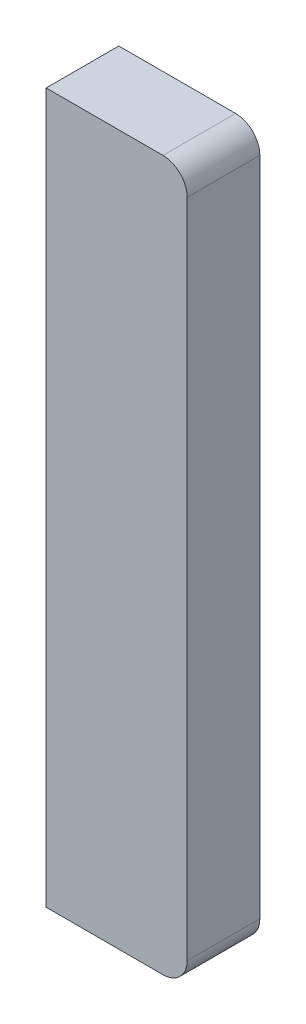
ISO-10303-21;
HEADER;
FILE_DESCRIPTION(('STEP AP214'),'2;1');
FILE_NAME('part.step','',(''),(''),'','','');
FILE_SCHEMA(('AUTOMOTIVE_DESIGN { 1 0 10303 214 1 1 1 1 }'));
ENDSEC;
DATA;
#1=APPLICATION_CONTEXT('core data for automotive mechanical design processes');
#2=APPLICATION_PROTOCOL_DEFINITION('international standard','automotive_design',2000,#1);
#3=PRODUCT_CONTEXT('',#1,'mechanical');
#4=PRODUCT('Part','Part','',(#3));
#5=PRODUCT_RELATED_PRODUCT_CATEGORY('part','',(#4));
#6=PRODUCT_DEFINITION_FORMATION('','',#4);
#7=PRODUCT_DEFINITION_CONTEXT('part definition',#1,'design');
#8=PRODUCT_DEFINITION('design','',#6,#7);
#9=PRODUCT_DEFINITION_SHAPE('','',#8);
#10=(LENGTH_UNIT() NAMED_UNIT(*) SI_UNIT(.MILLI.,.METRE.));
#11=(NAMED_UNIT(*) PLANE_ANGLE_UNIT() SI_UNIT($,.RADIAN.));
#12=(NAMED_UNIT(*) SI_UNIT($,.STERADIAN.) SOLID_ANGLE_UNIT());
#13=UNCERTAINTY_MEASURE_WITH_UNIT(LENGTH_MEASURE(1.E-05),#10,'distance_accuracy_value','');
#14=(GEOMETRIC_REPRESENTATION_CONTEXT(3) GLOBAL_UNCERTAINTY_ASSIGNED_CONTEXT((#13)) GLOBAL_UNIT_ASSIGNED_CONTEXT((#10,
#11,#12)) REPRESENTATION_CONTEXT('',''));
#15=CARTESIAN_POINT('',(0.,0.,0.));
#16=DIRECTION('',(0.,0.,1.));
#17=DIRECTION('',(1.,0.,0.));
#18=AXIS2_PLACEMENT_3D('',#15,#16,#17);
#19=CARTESIAN_POINT('',(14.8224463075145,-41.665103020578,0.));
#20=DIRECTION('',(0.,0.,1.));
#21=DIRECTION('',(1.,0.,0.));
#22=AXIS2_PLACEMENT_3D('',#19,#20,#21);
#23=PLANE('',#22);
#24=CARTESIAN_POINT('',(14.8224463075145,-41.665103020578,0.));
#25=DIRECTION('',(0.,0.,1.));
#26=DIRECTION('',(1.,0.,0.));
#27=AXIS2_PLACEMENT_3D('',#24,#25,#26);
#28=CIRCLE('',#27,1.);
#29=CARTESIAN_POINT('',(14.8224463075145,-42.665103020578,0.));
#30=VERTEX_POINT('',#29);
#31=CARTESIAN_POINT('',(15.8224463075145,-41.665103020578,0.));
#32=VERTEX_POINT('',#31);
#33=EDGE_CURVE('E97',#30,#32,#28,.T.);
#34=ORIENTED_EDGE('',*,*,#33,.F.);
#35=DIRECTION('',(1.,0.,0.));
#36=VECTOR('',#35,1.);
#37=CARTESIAN_POINT('',(14.8224463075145,-42.665103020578,0.));
#38=LINE('',#37,#36);
#39=CARTESIAN_POINT('',(10.,-42.665103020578,0.));
#40=VERTEX_POINT('',#39);
#41=EDGE_CURVE('E115',#40,#30,#38,.T.);
#42=ORIENTED_EDGE('',*,*,#41,.F.);
#43=DIRECTION('',(0.,-1.,0.));
#44=VECTOR('',#43,1.);
#45=CARTESIAN_POINT('',(10.,-42.665103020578,0.));
#46=LINE('',#45,#44);
#47=CARTESIAN_POINT('',(10.,-13.3635393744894,0.));
#48=VERTEX_POINT('',#47);
#49=EDGE_CURVE('E112',#48,#40,#46,.T.);
#50=ORIENTED_EDGE('',*,*,#49,.F.);
#51=DIRECTION('',(-1.,0.,0.));
#52=VECTOR('',#51,1.);
#53=CARTESIAN_POINT('',(14.8224463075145,-13.3635393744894,0.));
#54=LINE('',#53,#52);
#55=CARTESIAN_POINT('',(14.8224463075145,-13.3635393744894,0.));
#56=VERTEX_POINT('',#55);
#57=EDGE_CURVE('E109',#56,#48,#54,.T.);
#58=ORIENTED_EDGE('',*,*,#57,.F.);
#59=CARTESIAN_POINT('',(14.8224463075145,-14.3635393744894,0.));
#60=DIRECTION('',(0.,0.,1.));
#61=DIRECTION('',(1.,0.,0.));
#62=AXIS2_PLACEMENT_3D('',#59,#60,#61);
#63=CIRCLE('',#62,1.);
#64=CARTESIAN_POINT('',(15.8224463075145,-14.3635393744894,0.));
#65=VERTEX_POINT('',#64);
#66=EDGE_CURVE('E100',#65,#56,#63,.T.);
#67=ORIENTED_EDGE('',*,*,#66,.F.);
#68=DIRECTION('',(0.,1.,0.));
#69=VECTOR('',#68,1.);
#70=CARTESIAN_POINT('',(15.8224463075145,-14.3635393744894,0.));
#71=LINE('',#70,#69);
#72=EDGE_CURVE('E89',#32,#65,#71,.T.);
#73=ORIENTED_EDGE('',*,*,#72,.F.);
#74=EDGE_LOOP('',(#34,#42,#50,#58,#67,#73));
#75=FACE_BOUND('',#74,.T.);
#76=ADVANCED_FACE('F33',(#75),#23,.F.);
#77=CARTESIAN_POINT('',(14.8224463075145,-42.665103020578,32.8744458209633));
#78=DIRECTION('',(0.,1.,0.));
#79=DIRECTION('',(-1.,0.,0.));
#80=AXIS2_PLACEMENT_3D('',#77,#78,#79);
#81=PLANE('',#80);
#82=DIRECTION('',(0.,0.,-1.));
#83=VECTOR('',#82,1.);
#84=CARTESIAN_POINT('',(14.8224463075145,-42.665103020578,32.8744458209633));
#85=LINE('',#84,#83);
#86=CARTESIAN_POINT('',(14.8224463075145,-42.665103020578,3.));
#87=VERTEX_POINT('',#86);
#88=EDGE_CURVE('E103',#87,#30,#85,.T.);
#89=ORIENTED_EDGE('',*,*,#88,.F.);
#90=DIRECTION('',(-1.,0.,0.));
#91=VECTOR('',#90,1.);
#92=CARTESIAN_POINT('',(14.8224463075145,-42.665103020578,3.));
#93=LINE('',#92,#91);
#94=CARTESIAN_POINT('',(10.,-42.665103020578,3.));
#95=VERTEX_POINT('',#94);
#96=EDGE_CURVE('E37',#87,#95,#93,.T.);
#97=ORIENTED_EDGE('',*,*,#96,.T.);
#98=DIRECTION('',(0.,0.,-1.));
#99=VECTOR('',#98,1.);
#100=CARTESIAN_POINT('',(10.,-42.665103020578,32.8744458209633));
#101=LINE('',#100,#99);
#102=EDGE_CURVE('E118',#95,#40,#101,.T.);
#103=ORIENTED_EDGE('',*,*,#102,.T.);
#104=ORIENTED_EDGE('',*,*,#41,.T.);
#105=EDGE_LOOP('',(#89,#97,#103,#104));
#106=FACE_BOUND('',#105,.T.);
#107=ADVANCED_FACE('F137',(#106),#81,.F.);
#108=CARTESIAN_POINT('',(10.,-42.665103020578,32.8744458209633));
#109=DIRECTION('',(1.,0.,0.));
#110=DIRECTION('',(0.,1.,0.));
#111=AXIS2_PLACEMENT_3D('',#108,#109,#110);
#112=PLANE('',#111);
#113=ORIENTED_EDGE('',*,*,#102,.F.);
#114=DIRECTION('',(0.,1.,0.));
#115=VECTOR('',#114,1.);
#116=CARTESIAN_POINT('',(10.,-42.665103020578,3.));
#117=LINE('',#116,#115);
#118=CARTESIAN_POINT('',(10.,-13.3635393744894,3.));
#119=VERTEX_POINT('',#118);
#120=EDGE_CURVE('E129',#95,#119,#117,.T.);
#121=ORIENTED_EDGE('',*,*,#120,.T.);
#122=DIRECTION('',(0.,0.,-1.));
#123=VECTOR('',#122,1.);
#124=CARTESIAN_POINT('',(10.,-13.3635393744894,32.8744458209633));
#125=LINE('',#124,#123);
#126=EDGE_CURVE('E120',#119,#48,#125,.T.);
#127=ORIENTED_EDGE('',*,*,#126,.T.);
#128=ORIENTED_EDGE('',*,*,#49,.T.);
#129=EDGE_LOOP('',(#113,#121,#127,#128));
#130=FACE_BOUND('',#129,.T.);
#131=ADVANCED_FACE('F140',(#130),#112,.F.);
#132=CARTESIAN_POINT('',(14.8224463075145,-13.3635393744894,32.8744458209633));
#133=DIRECTION('',(0.,-1.,0.));
#134=DIRECTION('',(1.,0.,0.));
#135=AXIS2_PLACEMENT_3D('',#132,#133,#134);
#136=PLANE('',#135);
#137=ORIENTED_EDGE('',*,*,#126,.F.);
#138=DIRECTION('',(1.,0.,0.));
#139=VECTOR('',#138,1.);
#140=CARTESIAN_POINT('',(14.8224463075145,-13.3635393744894,3.));
#141=LINE('',#140,#139);
#142=CARTESIAN_POINT('',(14.8224463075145,-13.3635393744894,3.));
#143=VERTEX_POINT('',#142);
#144=EDGE_CURVE('E127',#119,#143,#141,.T.);
#145=ORIENTED_EDGE('',*,*,#144,.T.);
#146=DIRECTION('',(0.,0.,-1.));
#147=VECTOR('',#146,1.);
#148=CARTESIAN_POINT('',(14.8224463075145,-13.3635393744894,32.8744458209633));
#149=LINE('',#148,#147);
#150=EDGE_CURVE('E122',#143,#56,#149,.T.);
#151=ORIENTED_EDGE('',*,*,#150,.T.);
#152=ORIENTED_EDGE('',*,*,#57,.T.);
#153=EDGE_LOOP('',(#137,#145,#151,#152));
#154=FACE_BOUND('',#153,.T.);
#155=ADVANCED_FACE('F143',(#154),#136,.F.);
#156=CARTESIAN_POINT('',(14.8224463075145,-14.3635393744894,32.8744458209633));
#157=DIRECTION('',(0.,0.,-1.));
#158=DIRECTION('',(-1.,0.,0.));
#159=AXIS2_PLACEMENT_3D('',#156,#157,#158);
#160=CYLINDRICAL_SURFACE('',#159,1.);
#161=ORIENTED_EDGE('',*,*,#150,.F.);
#162=CARTESIAN_POINT('',(14.8224463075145,-14.3635393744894,3.));
#163=DIRECTION('',(0.,0.,-1.));
#164=DIRECTION('',(-1.,0.,0.));
#165=AXIS2_PLACEMENT_3D('',#162,#163,#164);
#166=CIRCLE('',#165,1.);
#167=CARTESIAN_POINT('',(15.8224463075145,-14.3635393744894,3.));
#168=VERTEX_POINT('',#167);
#169=EDGE_CURVE('E54',#143,#168,#166,.T.);
#170=ORIENTED_EDGE('',*,*,#169,.T.);
#171=DIRECTION('',(0.,0.,-1.));
#172=VECTOR('',#171,1.);
#173=CARTESIAN_POINT('',(15.8224463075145,-14.3635393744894,32.8744458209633));
#174=LINE('',#173,#172);
#175=EDGE_CURVE('E93',#168,#65,#174,.T.);
#176=ORIENTED_EDGE('',*,*,#175,.T.);
#177=ORIENTED_EDGE('',*,*,#66,.T.);
#178=EDGE_LOOP('',(#161,#170,#176,#177));
#179=FACE_BOUND('',#178,.T.);
#180=ADVANCED_FACE('F125',(#179),#160,.T.);
#181=CARTESIAN_POINT('',(15.8224463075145,-14.3635393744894,32.8744458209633));
#182=DIRECTION('',(-1.,0.,0.));
#183=DIRECTION('',(0.,-1.,0.));
#184=AXIS2_PLACEMENT_3D('',#181,#182,#183);
#185=PLANE('',#184);
#186=ORIENTED_EDGE('',*,*,#175,.F.);
#187=DIRECTION('',(0.,-1.,0.));
#188=VECTOR('',#187,1.);
#189=CARTESIAN_POINT('',(15.8224463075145,-14.3635393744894,3.));
#190=LINE('',#189,#188);
#191=CARTESIAN_POINT('',(15.8224463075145,-41.665103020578,3.));
#192=VERTEX_POINT('',#191);
#193=EDGE_CURVE('E42',#168,#192,#190,.T.);
#194=ORIENTED_EDGE('',*,*,#193,.T.);
#195=DIRECTION('',(0.,0.,-1.));
#196=VECTOR('',#195,1.);
#197=CARTESIAN_POINT('',(15.8224463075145,-41.665103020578,32.8744458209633));
#198=LINE('',#197,#196);
#199=EDGE_CURVE('E86',#192,#32,#198,.T.);
#200=ORIENTED_EDGE('',*,*,#199,.T.);
#201=ORIENTED_EDGE('',*,*,#72,.T.);
#202=EDGE_LOOP('',(#186,#194,#200,#201));
#203=FACE_BOUND('',#202,.T.);
#204=ADVANCED_FACE('F88',(#203),#185,.F.);
#205=CARTESIAN_POINT('',(14.8224463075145,-41.665103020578,32.8744458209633));
#206=DIRECTION('',(0.,0.,-1.));
#207=DIRECTION('',(-1.,0.,0.));
#208=AXIS2_PLACEMENT_3D('',#205,#206,#207);
#209=CYLINDRICAL_SURFACE('',#208,1.);
#210=ORIENTED_EDGE('',*,*,#199,.F.);
#211=CARTESIAN_POINT('',(14.8224463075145,-41.665103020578,3.));
#212=DIRECTION('',(0.,0.,-1.));
#213=DIRECTION('',(-1.,0.,0.));
#214=AXIS2_PLACEMENT_3D('',#211,#212,#213);
#215=CIRCLE('',#214,1.);
#216=EDGE_CURVE('E11',#192,#87,#215,.T.);
#217=ORIENTED_EDGE('',*,*,#216,.T.);
#218=ORIENTED_EDGE('',*,*,#88,.T.);
#219=ORIENTED_EDGE('',*,*,#33,.T.);
#220=EDGE_LOOP('',(#210,#217,#218,#219));
#221=FACE_BOUND('',#220,.T.);
#222=ADVANCED_FACE('F35',(#221),#209,.T.);
#223=CARTESIAN_POINT('',(8.75,-172.4387505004,3.));
#224=DIRECTION('',(0.,0.,-1.));
#225=DIRECTION('',(-1.,0.,0.));
#226=AXIS2_PLACEMENT_3D('',#223,#224,#225);
#227=PLANE('',#226);
#228=ORIENTED_EDGE('',*,*,#193,.F.);
#229=ORIENTED_EDGE('',*,*,#169,.F.);
#230=ORIENTED_EDGE('',*,*,#144,.F.);
#231=ORIENTED_EDGE('',*,*,#120,.F.);
#232=ORIENTED_EDGE('',*,*,#96,.F.);
#233=ORIENTED_EDGE('',*,*,#216,.F.);
#234=EDGE_LOOP('',(#228,#229,#230,#231,#232,#233));
#235=FACE_BOUND('',#234,.T.);
#236=ADVANCED_FACE('F138',(#235),#227,.F.);
#237=CLOSED_SHELL('',(#76,#107,#131,#155,#180,#204,#222,#236));
#238=MANIFOLD_SOLID_BREP('B2',#237);
#239=ADVANCED_BREP_SHAPE_REPRESENTATION('',(#18,#238),#14);
#240=SHAPE_DEFINITION_REPRESENTATION(#9,#239);
ENDSEC;
END-ISO-10303-21;
